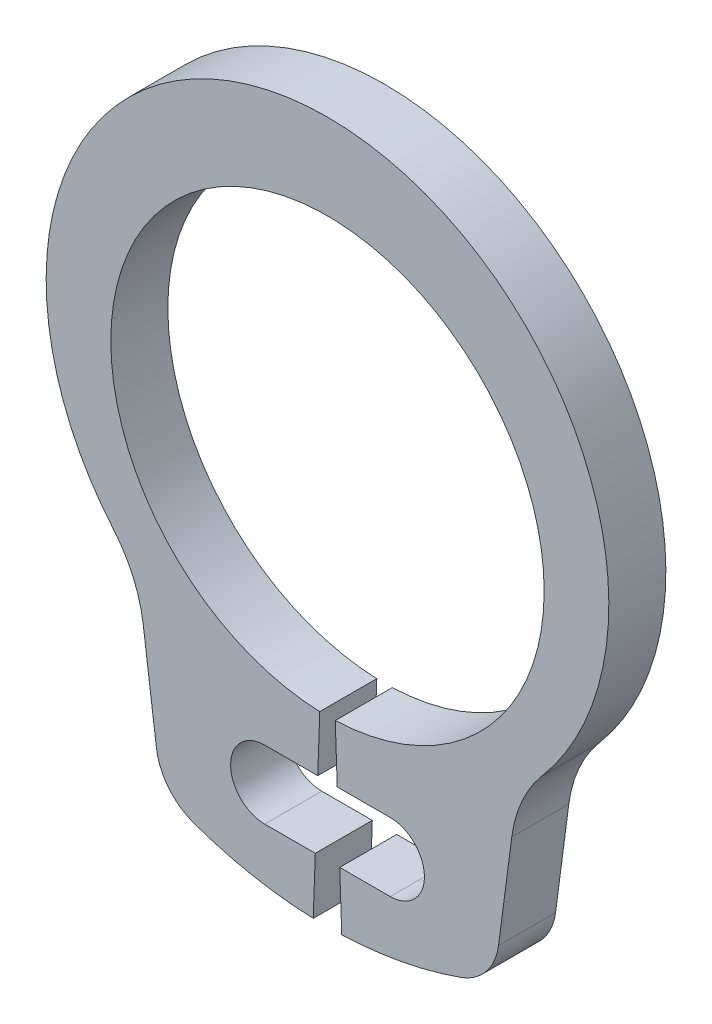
from build123d import *

# Parameters (mm, degrees)
BODYSKE_R   = 0.6
BODY_DEPTH  = 1
NOTSKE_W    = 2.2
NOTSKE_H    = 1.2
NOTCH_DEPTH = 9.618750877


with BuildPart() as part:
    # BodySke → Body (new body)
    with BuildSketch(Plane.XY):
        with BuildLine():
            Line((0.135714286, -3.797575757), (0.25, -6.99553429))
            ThreePointArc((0.25, -6.99553429), (1.311649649, -6.876014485), (2.342746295, -6.596327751))
            ThreePointArc((2.342746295, -6.596327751), (2.785504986, -6.282956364), (2.999513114, -5.784521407))
            Line((2.999513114, -5.784521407), (3.232103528, -4.017821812))
            ThreePointArc((3.232103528, -4.017821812), (3.409973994, -3.385728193), (3.759394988, -2.829773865))
            ThreePointArc((3.759394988, -2.829773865), (0, 5.3), (-3.759394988, -2.829773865))
            ThreePointArc((-3.759394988, -2.829773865), (-3.409973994, -3.385728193), (-3.232103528, -4.017821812))
            Line((-3.232103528, -4.017821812), (-2.999513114, -5.784521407))
            ThreePointArc((-2.999513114, -5.784521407), (-2.785504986, -6.282956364), (-2.342746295, -6.596327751))
            ThreePointArc((-2.342746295, -6.596327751), (-1.311649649, -6.876014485), (-0.25, -6.99553429))
            Line((-0.25, -6.99553429), (-0.135714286, -3.797575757))
            ThreePointArc((-0.135714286, -3.797575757), (0, 3.8), (0.135714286, -3.797575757))
        make_face()
        with Locations((1.1, -5.388877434)):
            Circle(BODYSKE_R, mode=Mode.SUBTRACT)
        with Locations((-1.1, -5.388877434)):
            Circle(BODYSKE_R, mode=Mode.SUBTRACT)
    extrude(amount=-BODY_DEPTH)

    # NotSke → Notch (cut, through all)
    with BuildSketch(Plane.XY):
        with Locations((0, -5.388877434)):
            Rectangle(NOTSKE_W, NOTSKE_H)
    extrude(amount=-NOTCH_DEPTH, mode=Mode.SUBTRACT)


solid = part.part
